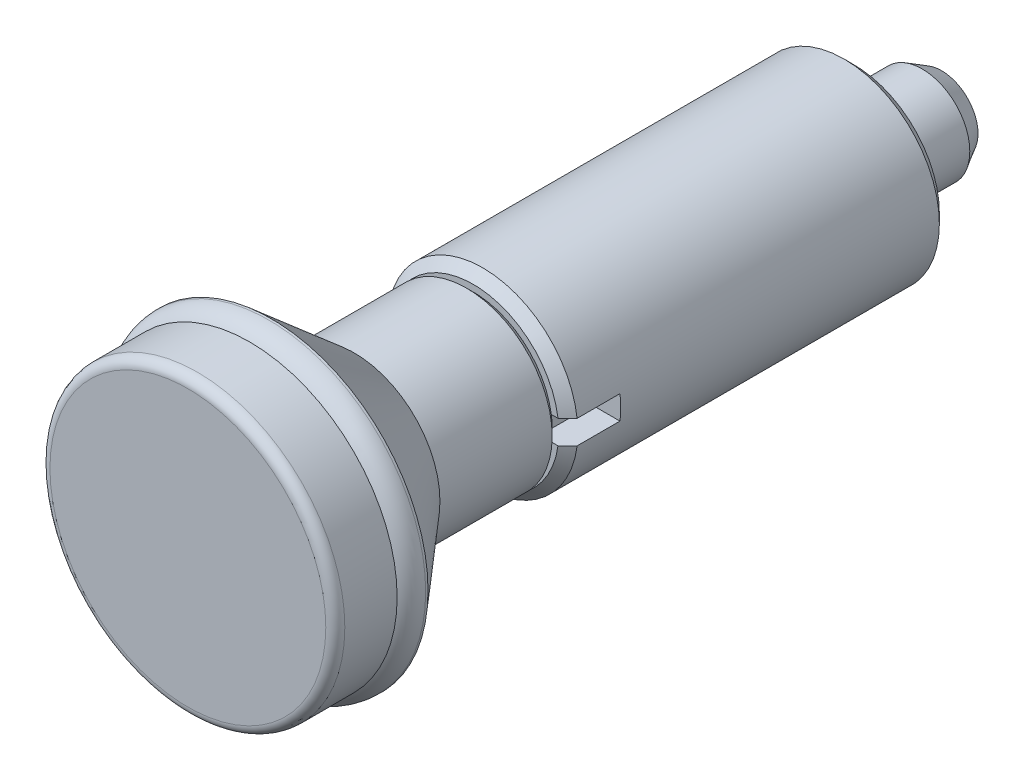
ISO-10303-21;
HEADER;
FILE_DESCRIPTION(('STEP AP214'),'2;1');
FILE_NAME('part.step','',(''),(''),'','','');
FILE_SCHEMA(('AUTOMOTIVE_DESIGN { 1 0 10303 214 1 1 1 1 }'));
ENDSEC;
DATA;
#1=APPLICATION_CONTEXT('core data for automotive mechanical design processes');
#2=APPLICATION_PROTOCOL_DEFINITION('international standard','automotive_design',2000,#1);
#3=PRODUCT_CONTEXT('',#1,'mechanical');
#4=PRODUCT('Part','Part','',(#3));
#5=PRODUCT_RELATED_PRODUCT_CATEGORY('part','',(#4));
#6=PRODUCT_DEFINITION_FORMATION('','',#4);
#7=PRODUCT_DEFINITION_CONTEXT('part definition',#1,'design');
#8=PRODUCT_DEFINITION('design','',#6,#7);
#9=PRODUCT_DEFINITION_SHAPE('','',#8);
#10=(LENGTH_UNIT() NAMED_UNIT(*) SI_UNIT(.MILLI.,.METRE.));
#11=(NAMED_UNIT(*) PLANE_ANGLE_UNIT() SI_UNIT($,.RADIAN.));
#12=(NAMED_UNIT(*) SI_UNIT($,.STERADIAN.) SOLID_ANGLE_UNIT());
#13=UNCERTAINTY_MEASURE_WITH_UNIT(LENGTH_MEASURE(1.E-05),#10,'distance_accuracy_value','');
#14=(GEOMETRIC_REPRESENTATION_CONTEXT(3) GLOBAL_UNCERTAINTY_ASSIGNED_CONTEXT((#13)) GLOBAL_UNIT_ASSIGNED_CONTEXT((#10,
#11,#12)) REPRESENTATION_CONTEXT('',''));
#15=CARTESIAN_POINT('',(0.,0.,0.));
#16=DIRECTION('',(0.,0.,1.));
#17=DIRECTION('',(1.,0.,0.));
#18=AXIS2_PLACEMENT_3D('',#15,#16,#17);
#19=CARTESIAN_POINT('',(0.,8.99999999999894,40.));
#20=DIRECTION('',(0.,0.,1.));
#21=DIRECTION('',(1.,0.,0.));
#22=AXIS2_PLACEMENT_3D('',#19,#20,#21);
#23=PLANE('',#22);
#24=DIRECTION('',(-1.,0.,0.));
#25=VECTOR('',#24,1.);
#26=CARTESIAN_POINT('',(-7.,1.25,40.));
#27=LINE('',#26,#25);
#28=CARTESIAN_POINT('',(-8.20533363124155,1.25,40.));
#29=VERTEX_POINT('',#28);
#30=CARTESIAN_POINT('',(-8.91277173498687,1.25,40.));
#31=VERTEX_POINT('',#30);
#32=EDGE_CURVE('E330',#29,#31,#27,.T.);
#33=ORIENTED_EDGE('',*,*,#32,.F.);
#34=CARTESIAN_POINT('',(0.,0.,40.));
#35=DIRECTION('',(0.,0.,1.));
#36=DIRECTION('',(1.,0.,0.));
#37=AXIS2_PLACEMENT_3D('',#34,#35,#36);
#38=CIRCLE('',#37,8.29999999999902);
#39=CARTESIAN_POINT('',(8.20533363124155,1.25,40.));
#40=VERTEX_POINT('',#39);
#41=EDGE_CURVE('E180',#40,#29,#38,.T.);
#42=ORIENTED_EDGE('',*,*,#41,.F.);
#43=DIRECTION('',(-1.,0.,0.));
#44=VECTOR('',#43,1.);
#45=CARTESIAN_POINT('',(7.,1.25,40.));
#46=LINE('',#45,#44);
#47=CARTESIAN_POINT('',(8.91277173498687,1.25,40.));
#48=VERTEX_POINT('',#47);
#49=EDGE_CURVE('E151',#48,#40,#46,.T.);
#50=ORIENTED_EDGE('',*,*,#49,.F.);
#51=CARTESIAN_POINT('',(0.,0.,40.));
#52=DIRECTION('',(0.,0.,1.));
#53=DIRECTION('',(1.,0.,0.));
#54=AXIS2_PLACEMENT_3D('',#51,#52,#53);
#55=CIRCLE('',#54,8.99999999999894);
#56=EDGE_CURVE('E176',#48,#31,#55,.T.);
#57=ORIENTED_EDGE('',*,*,#56,.T.);
#58=EDGE_LOOP('',(#33,#42,#50,#57));
#59=FACE_BOUND('',#58,.T.);
#60=ADVANCED_FACE('F14',(#59),#23,.T.);
#61=CARTESIAN_POINT('',(0.,0.,40.));
#62=DIRECTION('',(0.,0.,-1.));
#63=DIRECTION('',(-1.,0.,0.));
#64=AXIS2_PLACEMENT_3D('',#61,#62,#63);
#65=CONICAL_SURFACE('',#64,8.99999999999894,0.785398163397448);
#66=CARTESIAN_POINT('',(-4.73715555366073,1.25,44.1006997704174));
#67=CARTESIAN_POINT('',(-4.92218891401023,1.25,43.9217675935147));
#68=CARTESIAN_POINT('',(-5.10690410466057,1.25,43.742507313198));
#69=CARTESIAN_POINT('',(-5.47583283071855,1.25,43.3834722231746));
#70=CARTESIAN_POINT('',(-5.66004636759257,1.25,43.2036974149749));
#71=CARTESIAN_POINT('',(-6.02810627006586,1.25,42.8437751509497));
#72=CARTESIAN_POINT('',(-6.21195263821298,1.25,42.6636276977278));
#73=CARTESIAN_POINT('',(-6.57936050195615,1.25,42.303042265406));
#74=CARTESIAN_POINT('',(-6.76292199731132,1.25,42.1226042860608));
#75=CARTESIAN_POINT('',(-7.31327151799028,1.25,41.5809576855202));
#76=CARTESIAN_POINT('',(-7.67972840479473,1.25,41.219412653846));
#77=CARTESIAN_POINT('',(-8.4120730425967,1.25,40.4957455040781));
#78=CARTESIAN_POINT('',(-8.77796079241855,1.25,40.1336233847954));
#79=CARTESIAN_POINT('',(-9.50933794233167,1.25,39.4089852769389));
#80=CARTESIAN_POINT('',(-9.87482734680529,1.25,39.0464692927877));
#81=CARTESIAN_POINT('',(-10.6055262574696,1.25,38.3211560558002));
#82=CARTESIAN_POINT('',(-10.9707357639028,1.25,37.9583588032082));
#83=CARTESIAN_POINT('',(-12.0660458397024,1.25,36.8696339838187));
#84=CARTESIAN_POINT('',(-12.795821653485,1.25,36.1433796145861));
#85=CARTESIAN_POINT('',(-13.5254167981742,1.25,35.4169443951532));
#86=B_SPLINE_CURVE_WITH_KNOTS('',3,(#66,#67,#68,#69,#70,#71,#72,#73,#74,#75,#76,#77,#78,#79,#80,
#81,#82,#83,#84,#85),.UNSPECIFIED.,.F.,.F.,(4,2,2,2,2,2,2,2,2,4),(0.,0.772194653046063,
1.54438704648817,2.31657406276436,3.08876173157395,4.63312099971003,6.17748345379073,
7.72182874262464,9.26617269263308,12.3548872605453),.UNSPECIFIED.);
#87=CARTESIAN_POINT('',(-9.92156741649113,1.25,39.));
#88=VERTEX_POINT('',#87);
#89=EDGE_CURVE('E22',#31,#88,#86,.T.);
#90=ORIENTED_EDGE('',*,*,#89,.F.);
#91=ORIENTED_EDGE('',*,*,#56,.F.);
#92=CARTESIAN_POINT('',(13.9029555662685,1.25,35.0409644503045));
#93=CARTESIAN_POINT('',(13.1734482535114,1.25,35.7674860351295));
#94=CARTESIAN_POINT('',(12.4437703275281,1.25,36.4938368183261));
#95=CARTESIAN_POINT('',(11.3486675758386,1.25,37.5827689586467));
#96=CARTESIAN_POINT('',(10.9835368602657,1.25,37.9456461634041));
#97=CARTESIAN_POINT('',(10.2530237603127,1.25,38.6711476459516));
#98=CARTESIAN_POINT('',(9.88764137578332,1.25,39.0337719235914));
#99=CARTESIAN_POINT('',(9.15652427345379,1.25,39.7586710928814));
#100=CARTESIAN_POINT('',(8.79078955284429,1.25,40.1209459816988));
#101=CARTESIAN_POINT('',(8.05882030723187,1.25,40.8449895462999));
#102=CARTESIAN_POINT('',(7.69258578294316,1.25,41.2067582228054));
#103=CARTESIAN_POINT('',(6.95936504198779,1.25,41.9295389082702));
#104=CARTESIAN_POINT('',(6.59237882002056,1.25,42.2905509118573));
#105=CARTESIAN_POINT('',(6.04099141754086,1.25,42.8311448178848));
#106=CARTESIAN_POINT('',(5.85704383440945,1.25,43.0111891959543));
#107=CARTESIAN_POINT('',(5.48873931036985,1.25,43.3708593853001));
#108=CARTESIAN_POINT('',(5.30438236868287,1.25,43.5504851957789));
#109=CARTESIAN_POINT('',(5.11976761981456,1.25,43.7298462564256));
#110=B_SPLINE_CURVE_WITH_KNOTS('',3,(#92,#93,#94,#95,#96,#97,#98,#99,#100,#101,#102,#103,#104,
#105,#106,#107,#108,#109),.UNSPECIFIED.,.F.,.F.,(4,2,2,2,2,2,2,2,4),(0.,3.08871061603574,
4.63305596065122,6.17740222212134,7.72176090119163,9.26611737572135,10.8104847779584,
11.5826721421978,12.3548609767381),.UNSPECIFIED.);
#111=CARTESIAN_POINT('',(9.92156741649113,1.25,39.));
#112=VERTEX_POINT('',#111);
#113=EDGE_CURVE('E228',#112,#48,#110,.T.);
#114=ORIENTED_EDGE('',*,*,#113,.F.);
#115=CARTESIAN_POINT('',(0.,0.,39.));
#116=DIRECTION('',(0.,0.,1.));
#117=DIRECTION('',(1.,0.,0.));
#118=AXIS2_PLACEMENT_3D('',#115,#116,#117);
#119=CIRCLE('',#118,9.99999999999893);
#120=EDGE_CURVE('E173',#112,#88,#119,.T.);
#121=ORIENTED_EDGE('',*,*,#120,.T.);
#122=EDGE_LOOP('',(#90,#91,#114,#121));
#123=FACE_BOUND('',#122,.T.);
#124=ADVANCED_FACE('F259',(#123),#65,.T.);
#125=CARTESIAN_POINT('',(0.,0.,70.));
#126=DIRECTION('',(0.,0.,1.));
#127=DIRECTION('',(1.,0.,0.));
#128=AXIS2_PLACEMENT_3D('',#125,#126,#127);
#129=CYLINDRICAL_SURFACE('',#128,9.99999999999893);
#130=DIRECTION('',(0.,0.,1.));
#131=VECTOR('',#130,1.);
#132=CARTESIAN_POINT('',(-9.92156741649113,1.25,70.));
#133=LINE('',#132,#131);
#134=CARTESIAN_POINT('',(-9.92156741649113,1.25,34.5));
#135=VERTEX_POINT('',#134);
#136=EDGE_CURVE('E140',#88,#135,#133,.F.);
#137=ORIENTED_EDGE('',*,*,#136,.F.);
#138=ORIENTED_EDGE('',*,*,#120,.F.);
#139=DIRECTION('',(0.,0.,1.));
#140=VECTOR('',#139,1.);
#141=CARTESIAN_POINT('',(9.92156741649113,1.25,70.));
#142=LINE('',#141,#140);
#143=CARTESIAN_POINT('',(9.92156741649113,1.25,34.5));
#144=VERTEX_POINT('',#143);
#145=EDGE_CURVE('E170',#144,#112,#142,.T.);
#146=ORIENTED_EDGE('',*,*,#145,.F.);
#147=CARTESIAN_POINT('',(0.,0.,34.5));
#148=DIRECTION('',(0.,0.,1.));
#149=DIRECTION('',(1.,0.,0.));
#150=AXIS2_PLACEMENT_3D('',#147,#148,#149);
#151=CIRCLE('',#150,9.99999999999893);
#152=CARTESIAN_POINT('',(9.92156741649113,-1.25,34.5));
#153=VERTEX_POINT('',#152);
#154=EDGE_CURVE('E288',#144,#153,#151,.F.);
#155=ORIENTED_EDGE('',*,*,#154,.T.);
#156=DIRECTION('',(0.,0.,1.));
#157=VECTOR('',#156,1.);
#158=CARTESIAN_POINT('',(9.92156741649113,-1.25,70.));
#159=LINE('',#158,#157);
#160=CARTESIAN_POINT('',(9.92156741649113,-1.25,39.));
#161=VERTEX_POINT('',#160);
#162=EDGE_CURVE('E168',#161,#153,#159,.F.);
#163=ORIENTED_EDGE('',*,*,#162,.F.);
#164=CARTESIAN_POINT('',(-9.92156741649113,-1.25,39.));
#165=VERTEX_POINT('',#164);
#166=EDGE_CURVE('E172',#165,#161,#119,.T.);
#167=ORIENTED_EDGE('',*,*,#166,.F.);
#168=DIRECTION('',(0.,0.,1.));
#169=VECTOR('',#168,1.);
#170=CARTESIAN_POINT('',(-9.92156741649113,-1.25,70.));
#171=LINE('',#170,#169);
#172=CARTESIAN_POINT('',(-9.92156741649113,-1.25,34.5));
#173=VERTEX_POINT('',#172);
#174=EDGE_CURVE('E29',#173,#165,#171,.T.);
#175=ORIENTED_EDGE('',*,*,#174,.F.);
#176=CARTESIAN_POINT('',(0.,0.,34.5));
#177=DIRECTION('',(0.,0.,1.));
#178=DIRECTION('',(1.,0.,0.));
#179=AXIS2_PLACEMENT_3D('',#176,#177,#178);
#180=CIRCLE('',#179,9.99999999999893);
#181=EDGE_CURVE('E9',#173,#135,#180,.F.);
#182=ORIENTED_EDGE('',*,*,#181,.T.);
#183=EDGE_LOOP('',(#137,#138,#146,#155,#163,#167,#175,#182));
#184=FACE_BOUND('',#183,.T.);
#185=CARTESIAN_POINT('',(0.,0.,1.));
#186=DIRECTION('',(0.,0.,1.));
#187=DIRECTION('',(1.,0.,0.));
#188=AXIS2_PLACEMENT_3D('',#185,#186,#187);
#189=CIRCLE('',#188,9.99999999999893);
#190=CARTESIAN_POINT('',(9.99999999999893,0.,1.));
#191=VERTEX_POINT('',#190);
#192=EDGE_CURVE('E216',#191,#191,#189,.T.);
#193=ORIENTED_EDGE('',*,*,#192,.T.);
#194=EDGE_LOOP('',(#193));
#195=FACE_BOUND('',#194,.T.);
#196=ADVANCED_FACE('F16',(#184,#195),#129,.T.);
#197=CARTESIAN_POINT('',(0.,0.,1.));
#198=DIRECTION('',(0.,0.,1.));
#199=DIRECTION('',(1.,0.,0.));
#200=AXIS2_PLACEMENT_3D('',#197,#198,#199);
#201=CONICAL_SURFACE('',#200,9.99999999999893,0.785398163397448);
#202=CARTESIAN_POINT('',(0.,0.,0.));
#203=DIRECTION('',(0.,0.,1.));
#204=DIRECTION('',(1.,0.,0.));
#205=AXIS2_PLACEMENT_3D('',#202,#203,#204);
#206=CIRCLE('',#205,8.99999999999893);
#207=CARTESIAN_POINT('',(8.99999999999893,0.,0.));
#208=VERTEX_POINT('',#207);
#209=EDGE_CURVE('E213',#208,#208,#206,.T.);
#210=ORIENTED_EDGE('',*,*,#209,.T.);
#211=EDGE_LOOP('',(#210));
#212=FACE_BOUND('',#211,.T.);
#213=ORIENTED_EDGE('',*,*,#192,.F.);
#214=EDGE_LOOP('',(#213));
#215=FACE_BOUND('',#214,.T.);
#216=ADVANCED_FACE('F470',(#212,#215),#201,.T.);
#217=CARTESIAN_POINT('',(0.,4.99999999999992,0.));
#218=DIRECTION('',(0.,0.,-1.));
#219=DIRECTION('',(-1.,0.,0.));
#220=AXIS2_PLACEMENT_3D('',#217,#218,#219);
#221=PLANE('',#220);
#222=CARTESIAN_POINT('',(0.,0.,0.));
#223=DIRECTION('',(0.,0.,1.));
#224=DIRECTION('',(1.,0.,0.));
#225=AXIS2_PLACEMENT_3D('',#222,#223,#224);
#226=CIRCLE('',#225,4.99999999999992);
#227=CARTESIAN_POINT('',(4.99999999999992,0.,0.));
#228=VERTEX_POINT('',#227);
#229=EDGE_CURVE('E210',#228,#228,#226,.T.);
#230=ORIENTED_EDGE('',*,*,#229,.T.);
#231=EDGE_LOOP('',(#230));
#232=FACE_BOUND('',#231,.T.);
#233=ORIENTED_EDGE('',*,*,#209,.F.);
#234=EDGE_LOOP('',(#233));
#235=FACE_BOUND('',#234,.T.);
#236=ADVANCED_FACE('F460',(#232,#235),#221,.T.);
#237=CARTESIAN_POINT('',(0.,0.,70.));
#238=DIRECTION('',(0.,0.,1.));
#239=DIRECTION('',(1.,0.,0.));
#240=AXIS2_PLACEMENT_3D('',#237,#238,#239);
#241=CYLINDRICAL_SURFACE('',#240,4.99999999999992);
#242=CARTESIAN_POINT('',(0.,0.,-7.2));
#243=DIRECTION('',(0.,0.,1.));
#244=DIRECTION('',(1.,0.,0.));
#245=AXIS2_PLACEMENT_3D('',#242,#243,#244);
#246=CIRCLE('',#245,4.99999999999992);
#247=CARTESIAN_POINT('',(4.99999999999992,0.,-7.2));
#248=VERTEX_POINT('',#247);
#249=EDGE_CURVE('E207',#248,#248,#246,.T.);
#250=ORIENTED_EDGE('',*,*,#249,.T.);
#251=EDGE_LOOP('',(#250));
#252=FACE_BOUND('',#251,.T.);
#253=ORIENTED_EDGE('',*,*,#229,.F.);
#254=EDGE_LOOP('',(#253));
#255=FACE_BOUND('',#254,.T.);
#256=ADVANCED_FACE('F450',(#252,#255),#241,.T.);
#257=CARTESIAN_POINT('',(0.,0.,-7.2));
#258=DIRECTION('',(0.,0.,1.));
#259=DIRECTION('',(1.,0.,0.));
#260=AXIS2_PLACEMENT_3D('',#257,#258,#259);
#261=CONICAL_SURFACE('',#260,4.99999999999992,0.523598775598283);
#262=CARTESIAN_POINT('',(0.,0.,-9.2409344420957));
#263=DIRECTION('',(0.,0.,1.));
#264=DIRECTION('',(1.,0.,0.));
#265=AXIS2_PLACEMENT_3D('',#262,#263,#264);
#266=CIRCLE('',#265,3.82166595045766);
#267=CARTESIAN_POINT('',(3.82166595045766,0.,-9.2409344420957));
#268=VERTEX_POINT('',#267);
#269=EDGE_CURVE('E204',#268,#268,#266,.T.);
#270=ORIENTED_EDGE('',*,*,#269,.T.);
#271=EDGE_LOOP('',(#270));
#272=FACE_BOUND('',#271,.T.);
#273=ORIENTED_EDGE('',*,*,#249,.F.);
#274=EDGE_LOOP('',(#273));
#275=FACE_BOUND('',#274,.T.);
#276=ADVANCED_FACE('F440',(#272,#275),#261,.T.);
#277=CARTESIAN_POINT('',(0.,0.,0.));
#278=DIRECTION('',(0.,0.,1.));
#279=DIRECTION('',(0.,1.,0.));
#280=AXIS2_PLACEMENT_3D('',#277,#278,#279);
#281=SPHERICAL_SURFACE('',#280,10.);
#282=ORIENTED_EDGE('',*,*,#269,.F.);
#283=EDGE_LOOP('',(#282));
#284=FACE_BOUND('',#283,.T.);
#285=ADVANCED_FACE('F430',(#284),#281,.T.);
#286=CARTESIAN_POINT('',(0.,0.,70.));
#287=DIRECTION('',(0.,0.,1.));
#288=DIRECTION('',(1.,0.,0.));
#289=AXIS2_PLACEMENT_3D('',#286,#287,#288);
#290=PLANE('',#289);
#291=CARTESIAN_POINT('',(0.,0.,70.));
#292=DIRECTION('',(0.,0.,1.));
#293=DIRECTION('',(1.,0.,0.));
#294=AXIS2_PLACEMENT_3D('',#291,#292,#293);
#295=CIRCLE('',#294,14.5000000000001);
#296=CARTESIAN_POINT('',(14.5000000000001,0.,70.));
#297=VERTEX_POINT('',#296);
#298=EDGE_CURVE('E201',#297,#297,#295,.T.);
#299=ORIENTED_EDGE('',*,*,#298,.T.);
#300=EDGE_LOOP('',(#299));
#301=FACE_BOUND('',#300,.T.);
#302=ADVANCED_FACE('F420',(#301),#290,.T.);
#303=CARTESIAN_POINT('',(0.,0.,69.));
#304=DIRECTION('',(0.,0.,1.));
#305=DIRECTION('',(1.,0.,0.));
#306=AXIS2_PLACEMENT_3D('',#303,#304,#305);
#307=TOROIDAL_SURFACE('',#306,14.5000000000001,1.);
#308=CARTESIAN_POINT('',(0.,0.,69.));
#309=DIRECTION('',(0.,0.,1.));
#310=DIRECTION('',(1.,0.,0.));
#311=AXIS2_PLACEMENT_3D('',#308,#309,#310);
#312=CIRCLE('',#311,15.5);
#313=CARTESIAN_POINT('',(15.5,0.,69.));
#314=VERTEX_POINT('',#313);
#315=EDGE_CURVE('E198',#314,#314,#312,.T.);
#316=ORIENTED_EDGE('',*,*,#315,.T.);
#317=EDGE_LOOP('',(#316));
#318=FACE_BOUND('',#317,.T.);
#319=ORIENTED_EDGE('',*,*,#298,.F.);
#320=EDGE_LOOP('',(#319));
#321=FACE_BOUND('',#320,.T.);
#322=ADVANCED_FACE('F410',(#318,#321),#307,.T.);
#323=CARTESIAN_POINT('',(0.,0.,70.));
#324=DIRECTION('',(0.,0.,1.));
#325=DIRECTION('',(1.,0.,0.));
#326=AXIS2_PLACEMENT_3D('',#323,#324,#325);
#327=CYLINDRICAL_SURFACE('',#326,15.5);
#328=CARTESIAN_POINT('',(0.,0.,63.5));
#329=DIRECTION('',(0.,0.,1.));
#330=DIRECTION('',(1.,0.,0.));
#331=AXIS2_PLACEMENT_3D('',#328,#329,#330);
#332=CIRCLE('',#331,15.5);
#333=CARTESIAN_POINT('',(15.5,0.,63.5));
#334=VERTEX_POINT('',#333);
#335=EDGE_CURVE('E195',#334,#334,#332,.T.);
#336=ORIENTED_EDGE('',*,*,#335,.T.);
#337=EDGE_LOOP('',(#336));
#338=FACE_BOUND('',#337,.T.);
#339=ORIENTED_EDGE('',*,*,#315,.F.);
#340=EDGE_LOOP('',(#339));
#341=FACE_BOUND('',#340,.T.);
#342=ADVANCED_FACE('F400',(#338,#341),#327,.T.);
#343=CARTESIAN_POINT('',(0.,0.,61.5000000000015));
#344=DIRECTION('',(0.,0.,1.));
#345=DIRECTION('',(1.,0.,0.));
#346=AXIS2_PLACEMENT_3D('',#343,#344,#345);
#347=TOROIDAL_SURFACE('',#346,14.0000000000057,2.49999999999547);
#348=CARTESIAN_POINT('',(0.,0.,61.5000033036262));
#349=DIRECTION('',(0.,0.,1.));
#350=DIRECTION('',(1.,0.,0.));
#351=AXIS2_PLACEMENT_3D('',#348,#349,#350);
#352=CIRCLE('',#351,16.499999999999);
#353=CARTESIAN_POINT('',(16.499999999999,0.,61.5000033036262));
#354=VERTEX_POINT('',#353);
#355=EDGE_CURVE('E192',#354,#354,#352,.T.);
#356=ORIENTED_EDGE('',*,*,#355,.T.);
#357=EDGE_LOOP('',(#356));
#358=FACE_BOUND('',#357,.T.);
#359=ORIENTED_EDGE('',*,*,#335,.F.);
#360=EDGE_LOOP('',(#359));
#361=FACE_BOUND('',#360,.T.);
#362=ADVANCED_FACE('F390',(#358,#361),#347,.T.);
#363=CARTESIAN_POINT('',(0.,0.,70.));
#364=DIRECTION('',(0.,0.,1.));
#365=DIRECTION('',(1.,0.,0.));
#366=AXIS2_PLACEMENT_3D('',#363,#364,#365);
#367=CYLINDRICAL_SURFACE('',#366,16.499999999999);
#368=CARTESIAN_POINT('',(0.,0.,61.2528361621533));
#369=DIRECTION('',(0.,0.,1.));
#370=DIRECTION('',(1.,0.,0.));
#371=AXIS2_PLACEMENT_3D('',#368,#369,#370);
#372=CIRCLE('',#371,16.499999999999);
#373=CARTESIAN_POINT('',(16.499999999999,0.,61.2528361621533));
#374=VERTEX_POINT('',#373);
#375=EDGE_CURVE('E189',#374,#374,#372,.T.);
#376=ORIENTED_EDGE('',*,*,#375,.T.);
#377=EDGE_LOOP('',(#376));
#378=FACE_BOUND('',#377,.T.);
#379=ORIENTED_EDGE('',*,*,#355,.F.);
#380=EDGE_LOOP('',(#379));
#381=FACE_BOUND('',#380,.T.);
#382=ADVANCED_FACE('F380',(#378,#381),#367,.T.);
#383=CARTESIAN_POINT('',(0.,0.,61.2528361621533));
#384=DIRECTION('',(0.,0.,1.));
#385=DIRECTION('',(1.,0.,0.));
#386=AXIS2_PLACEMENT_3D('',#383,#384,#385);
#387=CONICAL_SURFACE('',#386,16.499999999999,0.708466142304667);
#388=CARTESIAN_POINT('',(0.,0.,52.5));
#389=DIRECTION('',(0.,0.,1.));
#390=DIRECTION('',(1.,0.,0.));
#391=AXIS2_PLACEMENT_3D('',#388,#389,#390);
#392=CIRCLE('',#391,8.99999999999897);
#393=CARTESIAN_POINT('',(8.99999999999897,0.,52.5));
#394=VERTEX_POINT('',#393);
#395=EDGE_CURVE('E186',#394,#394,#392,.T.);
#396=ORIENTED_EDGE('',*,*,#395,.T.);
#397=EDGE_LOOP('',(#396));
#398=FACE_BOUND('',#397,.T.);
#399=ORIENTED_EDGE('',*,*,#375,.F.);
#400=EDGE_LOOP('',(#399));
#401=FACE_BOUND('',#400,.T.);
#402=ADVANCED_FACE('F369',(#398,#401),#387,.T.);
#403=CARTESIAN_POINT('',(0.,0.,70.));
#404=DIRECTION('',(0.,0.,1.));
#405=DIRECTION('',(1.,0.,0.));
#406=AXIS2_PLACEMENT_3D('',#403,#404,#405);
#407=CYLINDRICAL_SURFACE('',#406,8.99999999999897);
#408=CARTESIAN_POINT('',(0.,0.,40.7));
#409=DIRECTION('',(0.,0.,1.));
#410=DIRECTION('',(1.,0.,0.));
#411=AXIS2_PLACEMENT_3D('',#408,#409,#410);
#412=CIRCLE('',#411,8.99999999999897);
#413=CARTESIAN_POINT('',(8.99999999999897,0.,40.7));
#414=VERTEX_POINT('',#413);
#415=EDGE_CURVE('E183',#414,#414,#412,.T.);
#416=ORIENTED_EDGE('',*,*,#415,.T.);
#417=EDGE_LOOP('',(#416));
#418=FACE_BOUND('',#417,.T.);
#419=ORIENTED_EDGE('',*,*,#395,.F.);
#420=EDGE_LOOP('',(#419));
#421=FACE_BOUND('',#420,.T.);
#422=ADVANCED_FACE('F275',(#418,#421),#407,.T.);
#423=CARTESIAN_POINT('',(0.,0.,40.7));
#424=DIRECTION('',(0.,0.,1.));
#425=DIRECTION('',(1.,0.,0.));
#426=AXIS2_PLACEMENT_3D('',#423,#424,#425);
#427=CONICAL_SURFACE('',#426,8.99999999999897,0.785398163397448);
#428=ORIENTED_EDGE('',*,*,#41,.T.);
#429=CARTESIAN_POINT('',(0.,0.,40.));
#430=DIRECTION('',(0.,0.,1.));
#431=DIRECTION('',(1.,0.,0.));
#432=AXIS2_PLACEMENT_3D('',#429,#430,#431);
#433=CIRCLE('',#432,8.29999999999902);
#434=CARTESIAN_POINT('',(-8.20533363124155,-1.25,40.));
#435=VERTEX_POINT('',#434);
#436=EDGE_CURVE('E136',#435,#29,#433,.F.);
#437=ORIENTED_EDGE('',*,*,#436,.F.);
#438=CARTESIAN_POINT('',(8.20533363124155,-1.25,40.));
#439=VERTEX_POINT('',#438);
#440=EDGE_CURVE('E179',#435,#439,#38,.T.);
#441=ORIENTED_EDGE('',*,*,#440,.T.);
#442=CARTESIAN_POINT('',(0.,0.,40.));
#443=DIRECTION('',(0.,0.,1.));
#444=DIRECTION('',(1.,0.,0.));
#445=AXIS2_PLACEMENT_3D('',#442,#443,#444);
#446=CIRCLE('',#445,8.29999999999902);
#447=EDGE_CURVE('E164',#40,#439,#446,.F.);
#448=ORIENTED_EDGE('',*,*,#447,.F.);
#449=EDGE_LOOP('',(#428,#437,#441,#448));
#450=FACE_BOUND('',#449,.T.);
#451=ORIENTED_EDGE('',*,*,#415,.F.);
#452=EDGE_LOOP('',(#451));
#453=FACE_BOUND('',#452,.T.);
#454=ADVANCED_FACE('F270',(#450,#453),#427,.T.);
#455=DIRECTION('',(1.,0.,0.));
#456=VECTOR('',#455,1.);
#457=CARTESIAN_POINT('',(-7.,-1.25,40.));
#458=LINE('',#457,#456);
#459=CARTESIAN_POINT('',(-8.91277173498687,-1.25,40.));
#460=VERTEX_POINT('',#459);
#461=EDGE_CURVE('E110',#460,#435,#458,.T.);
#462=ORIENTED_EDGE('',*,*,#461,.F.);
#463=CARTESIAN_POINT('',(8.91277173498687,-1.25,40.));
#464=VERTEX_POINT('',#463);
#465=EDGE_CURVE('E37',#460,#464,#55,.T.);
#466=ORIENTED_EDGE('',*,*,#465,.T.);
#467=DIRECTION('',(1.,0.,0.));
#468=VECTOR('',#467,1.);
#469=CARTESIAN_POINT('',(7.,-1.25,40.));
#470=LINE('',#469,#468);
#471=EDGE_CURVE('E145',#439,#464,#470,.T.);
#472=ORIENTED_EDGE('',*,*,#471,.F.);
#473=ORIENTED_EDGE('',*,*,#440,.F.);
#474=EDGE_LOOP('',(#462,#466,#472,#473));
#475=FACE_BOUND('',#474,.T.);
#476=ADVANCED_FACE('F257',(#475),#23,.T.);
#477=CARTESIAN_POINT('',(-13.5254167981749,-1.25,35.4169443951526));
#478=CARTESIAN_POINT('',(-12.7958216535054,-1.25,36.1433796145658));
#479=CARTESIAN_POINT('',(-12.0660458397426,-1.25,36.8696339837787));
#480=CARTESIAN_POINT('',(-10.9707357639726,-1.25,37.9583588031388));
#481=CARTESIAN_POINT('',(-10.6055262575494,-1.25,38.321156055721));
#482=CARTESIAN_POINT('',(-9.87482734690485,-1.25,39.0464692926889));
#483=CARTESIAN_POINT('',(-9.50933794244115,-1.25,39.4089852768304));
#484=CARTESIAN_POINT('',(-8.77796079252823,-1.25,40.1336233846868));
#485=CARTESIAN_POINT('',(-8.41207304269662,-1.25,40.4957455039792));
#486=CARTESIAN_POINT('',(-7.67972840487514,-1.25,41.2194126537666));
#487=CARTESIAN_POINT('',(-7.31327151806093,-1.25,41.5809576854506));
#488=CARTESIAN_POINT('',(-6.7629219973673,-1.25,42.1226042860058));
#489=CARTESIAN_POINT('',(-6.57936050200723,-1.25,42.3030422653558));
#490=CARTESIAN_POINT('',(-6.21195263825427,-1.25,42.6636276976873));
#491=CARTESIAN_POINT('',(-6.02810627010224,-1.25,42.8437751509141));
#492=CARTESIAN_POINT('',(-5.66004636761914,-1.25,43.203697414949));
#493=CARTESIAN_POINT('',(-5.47583283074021,-1.25,43.3834722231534));
#494=CARTESIAN_POINT('',(-5.10690410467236,-1.25,43.7425073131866));
#495=CARTESIAN_POINT('',(-4.92218891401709,-1.25,43.9217675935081));
#496=CARTESIAN_POINT('',(-4.73715555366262,-1.25,44.1006997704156));
#497=B_SPLINE_CURVE_WITH_KNOTS('',3,(#477,#478,#479,#480,#481,#482,#483,#484,#485,#486,#487,
#488,#489,#490,#491,#492,#493,#494,#495,#496),.UNSPECIFIED.,.F.,.F.,(4,2,2,2,2,2,2,2,2,4),(0.,
3.08871456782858,4.63305851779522,6.17740380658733,7.7217662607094,9.26612552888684,
10.0383131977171,10.810500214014,11.5826926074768,12.3548872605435),.UNSPECIFIED.);
#498=EDGE_CURVE('E279',#165,#460,#497,.T.);
#499=ORIENTED_EDGE('',*,*,#498,.F.);
#500=ORIENTED_EDGE('',*,*,#166,.T.);
#501=CARTESIAN_POINT('',(5.11976761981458,-1.25,43.7298462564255));
#502=CARTESIAN_POINT('',(5.30438236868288,-1.25,43.5504851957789));
#503=CARTESIAN_POINT('',(5.48873931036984,-1.25,43.3708593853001));
#504=CARTESIAN_POINT('',(5.85704383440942,-1.25,43.0111891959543));
#505=CARTESIAN_POINT('',(6.04099141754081,-1.25,42.8311448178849));
#506=CARTESIAN_POINT('',(6.59237882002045,-1.25,42.2905509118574));
#507=CARTESIAN_POINT('',(6.95936504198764,-1.25,41.9295389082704));
#508=CARTESIAN_POINT('',(7.69258578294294,-1.25,41.2067582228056));
#509=CARTESIAN_POINT('',(8.05882030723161,-1.25,40.8449895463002));
#510=CARTESIAN_POINT('',(8.79078955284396,-1.25,40.1209459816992));
#511=CARTESIAN_POINT('',(9.15652427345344,-1.25,39.7586710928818));
#512=CARTESIAN_POINT('',(9.88764137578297,-1.25,39.0337719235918));
#513=CARTESIAN_POINT('',(10.2530237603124,-1.25,38.671147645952));
#514=CARTESIAN_POINT('',(10.9835368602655,-1.25,37.9456461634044));
#515=CARTESIAN_POINT('',(11.3486675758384,-1.25,37.5827689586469));
#516=CARTESIAN_POINT('',(12.443770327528,-1.25,36.4938368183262));
#517=CARTESIAN_POINT('',(13.1734482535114,-1.25,35.7674860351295));
#518=CARTESIAN_POINT('',(13.9029555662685,-1.25,35.0409644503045));
#519=B_SPLINE_CURVE_WITH_KNOTS('',3,(#501,#502,#503,#504,#505,#506,#507,#508,#509,#510,#511,
#512,#513,#514,#515,#516,#517,#518),.UNSPECIFIED.,.F.,.F.,(4,2,2,2,2,2,2,2,4),(0.,
0.772188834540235,1.54437619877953,3.08874360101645,4.63310007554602,6.17745875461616,
7.72180501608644,9.26615036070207,12.3548609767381),.UNSPECIFIED.);
#520=EDGE_CURVE('E219',#464,#161,#519,.T.);
#521=ORIENTED_EDGE('',*,*,#520,.F.);
#522=ORIENTED_EDGE('',*,*,#465,.F.);
#523=EDGE_LOOP('',(#499,#500,#521,#522));
#524=FACE_BOUND('',#523,.T.);
#525=ADVANCED_FACE('F235',(#524),#65,.T.);
#526=CARTESIAN_POINT('',(7.,1.25,34.5));
#527=DIRECTION('',(-1.,0.,0.));
#528=DIRECTION('',(0.,0.,1.));
#529=AXIS2_PLACEMENT_3D('',#526,#527,#528);
#530=PLANE('',#529);
#531=DIRECTION('',(0.,-1.,0.));
#532=VECTOR('',#531,1.);
#533=CARTESIAN_POINT('',(7.,1.25,40.));
#534=LINE('',#533,#532);
#535=CARTESIAN_POINT('',(7.,1.25,40.));
#536=VERTEX_POINT('',#535);
#537=CARTESIAN_POINT('',(7.,-1.25,40.));
#538=VERTEX_POINT('',#537);
#539=EDGE_CURVE('E142',#536,#538,#534,.T.);
#540=ORIENTED_EDGE('',*,*,#539,.T.);
#541=DIRECTION('',(0.,0.,1.));
#542=VECTOR('',#541,1.);
#543=CARTESIAN_POINT('',(7.,-1.25,34.5));
#544=LINE('',#543,#542);
#545=CARTESIAN_POINT('',(7.,-1.25,34.5));
#546=VERTEX_POINT('',#545);
#547=EDGE_CURVE('E160',#546,#538,#544,.T.);
#548=ORIENTED_EDGE('',*,*,#547,.F.);
#549=DIRECTION('',(0.,-1.,0.));
#550=VECTOR('',#549,1.);
#551=CARTESIAN_POINT('',(7.,1.25,34.5));
#552=LINE('',#551,#550);
#553=CARTESIAN_POINT('',(7.,1.25,34.5));
#554=VERTEX_POINT('',#553);
#555=EDGE_CURVE('E152',#554,#546,#552,.T.);
#556=ORIENTED_EDGE('',*,*,#555,.F.);
#557=DIRECTION('',(0.,0.,1.));
#558=VECTOR('',#557,1.);
#559=CARTESIAN_POINT('',(7.,1.25,34.5));
#560=LINE('',#559,#558);
#561=EDGE_CURVE('E161',#554,#536,#560,.T.);
#562=ORIENTED_EDGE('',*,*,#561,.T.);
#563=EDGE_LOOP('',(#540,#548,#556,#562));
#564=FACE_BOUND('',#563,.T.);
#565=ADVANCED_FACE('F247',(#564),#530,.F.);
#566=CARTESIAN_POINT('',(7.,1.25,34.5));
#567=DIRECTION('',(0.,1.,0.));
#568=DIRECTION('',(-1.,0.,0.));
#569=AXIS2_PLACEMENT_3D('',#566,#567,#568);
#570=PLANE('',#569);
#571=ORIENTED_EDGE('',*,*,#145,.T.);
#572=ORIENTED_EDGE('',*,*,#113,.T.);
#573=ORIENTED_EDGE('',*,*,#49,.T.);
#574=EDGE_CURVE('E149',#40,#536,#46,.T.);
#575=ORIENTED_EDGE('',*,*,#574,.T.);
#576=ORIENTED_EDGE('',*,*,#561,.F.);
#577=DIRECTION('',(-1.,0.,0.));
#578=VECTOR('',#577,1.);
#579=CARTESIAN_POINT('',(7.,1.25,34.5));
#580=LINE('',#579,#578);
#581=EDGE_CURVE('E158',#144,#554,#580,.T.);
#582=ORIENTED_EDGE('',*,*,#581,.F.);
#583=EDGE_LOOP('',(#571,#572,#573,#575,#576,#582));
#584=FACE_BOUND('',#583,.T.);
#585=ADVANCED_FACE('F243',(#584),#570,.F.);
#586=CARTESIAN_POINT('',(7.,-1.25,34.5));
#587=DIRECTION('',(0.,-1.,0.));
#588=DIRECTION('',(1.,0.,0.));
#589=AXIS2_PLACEMENT_3D('',#586,#587,#588);
#590=PLANE('',#589);
#591=ORIENTED_EDGE('',*,*,#162,.T.);
#592=DIRECTION('',(1.,0.,0.));
#593=VECTOR('',#592,1.);
#594=CARTESIAN_POINT('',(7.,-1.25,34.5));
#595=LINE('',#594,#593);
#596=EDGE_CURVE('E155',#546,#153,#595,.T.);
#597=ORIENTED_EDGE('',*,*,#596,.F.);
#598=ORIENTED_EDGE('',*,*,#547,.T.);
#599=EDGE_CURVE('E146',#538,#439,#470,.T.);
#600=ORIENTED_EDGE('',*,*,#599,.T.);
#601=ORIENTED_EDGE('',*,*,#471,.T.);
#602=ORIENTED_EDGE('',*,*,#520,.T.);
#603=EDGE_LOOP('',(#591,#597,#598,#600,#601,#602));
#604=FACE_BOUND('',#603,.T.);
#605=ADVANCED_FACE('F239',(#604),#590,.F.);
#606=CARTESIAN_POINT('',(7.,-1.25,34.5));
#607=DIRECTION('',(0.,0.,1.));
#608=DIRECTION('',(1.,0.,0.));
#609=AXIS2_PLACEMENT_3D('',#606,#607,#608);
#610=PLANE('',#609);
#611=ORIENTED_EDGE('',*,*,#581,.T.);
#612=ORIENTED_EDGE('',*,*,#555,.T.);
#613=ORIENTED_EDGE('',*,*,#596,.T.);
#614=ORIENTED_EDGE('',*,*,#154,.F.);
#615=EDGE_LOOP('',(#611,#612,#613,#614));
#616=FACE_BOUND('',#615,.T.);
#617=ADVANCED_FACE('F242',(#616),#610,.T.);
#618=CARTESIAN_POINT('',(7.,-1.25,40.));
#619=DIRECTION('',(0.,0.,1.));
#620=DIRECTION('',(1.,0.,0.));
#621=AXIS2_PLACEMENT_3D('',#618,#619,#620);
#622=PLANE('',#621);
#623=ORIENTED_EDGE('',*,*,#447,.T.);
#624=ORIENTED_EDGE('',*,*,#599,.F.);
#625=ORIENTED_EDGE('',*,*,#539,.F.);
#626=ORIENTED_EDGE('',*,*,#574,.F.);
#627=EDGE_LOOP('',(#623,#624,#625,#626));
#628=FACE_BOUND('',#627,.T.);
#629=ADVANCED_FACE('F312',(#628),#622,.F.);
#630=CARTESIAN_POINT('',(-7.,1.25,34.5));
#631=DIRECTION('',(0.,1.,0.));
#632=DIRECTION('',(-1.,0.,0.));
#633=AXIS2_PLACEMENT_3D('',#630,#631,#632);
#634=PLANE('',#633);
#635=ORIENTED_EDGE('',*,*,#136,.T.);
#636=DIRECTION('',(-1.,0.,0.));
#637=VECTOR('',#636,1.);
#638=CARTESIAN_POINT('',(-7.,1.25,34.5));
#639=LINE('',#638,#637);
#640=CARTESIAN_POINT('',(-7.,1.25,34.5));
#641=VERTEX_POINT('',#640);
#642=EDGE_CURVE('E127',#641,#135,#639,.T.);
#643=ORIENTED_EDGE('',*,*,#642,.F.);
#644=DIRECTION('',(0.,0.,1.));
#645=VECTOR('',#644,1.);
#646=CARTESIAN_POINT('',(-7.,1.25,34.5));
#647=LINE('',#646,#645);
#648=CARTESIAN_POINT('',(-7.,1.25,40.));
#649=VERTEX_POINT('',#648);
#650=EDGE_CURVE('E122',#641,#649,#647,.T.);
#651=ORIENTED_EDGE('',*,*,#650,.T.);
#652=EDGE_CURVE('E114',#649,#29,#27,.T.);
#653=ORIENTED_EDGE('',*,*,#652,.T.);
#654=ORIENTED_EDGE('',*,*,#32,.T.);
#655=ORIENTED_EDGE('',*,*,#89,.T.);
#656=EDGE_LOOP('',(#635,#643,#651,#653,#654,#655));
#657=FACE_BOUND('',#656,.T.);
#658=ADVANCED_FACE('F308',(#657),#634,.F.);
#659=CARTESIAN_POINT('',(-7.,1.25,34.5));
#660=DIRECTION('',(1.,0.,0.));
#661=DIRECTION('',(0.,0.,-1.));
#662=AXIS2_PLACEMENT_3D('',#659,#660,#661);
#663=PLANE('',#662);
#664=DIRECTION('',(0.,1.,0.));
#665=VECTOR('',#664,1.);
#666=CARTESIAN_POINT('',(-7.,1.25,40.));
#667=LINE('',#666,#665);
#668=CARTESIAN_POINT('',(-7.,-1.25,40.));
#669=VERTEX_POINT('',#668);
#670=EDGE_CURVE('E119',#669,#649,#667,.T.);
#671=ORIENTED_EDGE('',*,*,#670,.T.);
#672=ORIENTED_EDGE('',*,*,#650,.F.);
#673=DIRECTION('',(0.,1.,0.));
#674=VECTOR('',#673,1.);
#675=CARTESIAN_POINT('',(-7.,1.25,34.5));
#676=LINE('',#675,#674);
#677=CARTESIAN_POINT('',(-7.,-1.25,34.5));
#678=VERTEX_POINT('',#677);
#679=EDGE_CURVE('E121',#678,#641,#676,.T.);
#680=ORIENTED_EDGE('',*,*,#679,.F.);
#681=DIRECTION('',(0.,0.,1.));
#682=VECTOR('',#681,1.);
#683=CARTESIAN_POINT('',(-7.,-1.25,34.5));
#684=LINE('',#683,#682);
#685=EDGE_CURVE('E108',#678,#669,#684,.T.);
#686=ORIENTED_EDGE('',*,*,#685,.T.);
#687=EDGE_LOOP('',(#671,#672,#680,#686));
#688=FACE_BOUND('',#687,.T.);
#689=ADVANCED_FACE('F118',(#688),#663,.F.);
#690=CARTESIAN_POINT('',(-7.,-1.25,34.5));
#691=DIRECTION('',(0.,-1.,0.));
#692=DIRECTION('',(1.,0.,0.));
#693=AXIS2_PLACEMENT_3D('',#690,#691,#692);
#694=PLANE('',#693);
#695=ORIENTED_EDGE('',*,*,#174,.T.);
#696=ORIENTED_EDGE('',*,*,#498,.T.);
#697=ORIENTED_EDGE('',*,*,#461,.T.);
#698=EDGE_CURVE('E105',#435,#669,#458,.T.);
#699=ORIENTED_EDGE('',*,*,#698,.T.);
#700=ORIENTED_EDGE('',*,*,#685,.F.);
#701=DIRECTION('',(1.,0.,0.));
#702=VECTOR('',#701,1.);
#703=CARTESIAN_POINT('',(-7.,-1.25,34.5));
#704=LINE('',#703,#702);
#705=EDGE_CURVE('E130',#173,#678,#704,.T.);
#706=ORIENTED_EDGE('',*,*,#705,.F.);
#707=EDGE_LOOP('',(#695,#696,#697,#699,#700,#706));
#708=FACE_BOUND('',#707,.T.);
#709=ADVANCED_FACE('F107',(#708),#694,.F.);
#710=CARTESIAN_POINT('',(-20.1251381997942,1.25,34.5));
#711=DIRECTION('',(0.,0.,1.));
#712=DIRECTION('',(1.,0.,0.));
#713=AXIS2_PLACEMENT_3D('',#710,#711,#712);
#714=PLANE('',#713);
#715=ORIENTED_EDGE('',*,*,#705,.T.);
#716=ORIENTED_EDGE('',*,*,#679,.T.);
#717=ORIENTED_EDGE('',*,*,#642,.T.);
#718=ORIENTED_EDGE('',*,*,#181,.F.);
#719=EDGE_LOOP('',(#715,#716,#717,#718));
#720=FACE_BOUND('',#719,.T.);
#721=ADVANCED_FACE('F306',(#720),#714,.T.);
#722=CARTESIAN_POINT('',(-20.1251381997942,1.25,40.));
#723=DIRECTION('',(0.,0.,1.));
#724=DIRECTION('',(1.,0.,0.));
#725=AXIS2_PLACEMENT_3D('',#722,#723,#724);
#726=PLANE('',#725);
#727=ORIENTED_EDGE('',*,*,#436,.T.);
#728=ORIENTED_EDGE('',*,*,#652,.F.);
#729=ORIENTED_EDGE('',*,*,#670,.F.);
#730=ORIENTED_EDGE('',*,*,#698,.F.);
#731=EDGE_LOOP('',(#727,#728,#729,#730));
#732=FACE_BOUND('',#731,.T.);
#733=ADVANCED_FACE('F125',(#732),#726,.F.);
#734=CLOSED_SHELL('',(#60,#124,#196,#216,#236,#256,#276,#285,#302,#322,#342,#362,#382,#402,#422,
#454,#476,#525,#565,#585,#605,#617,#629,#658,#689,#709,#721,#733));
#735=MANIFOLD_SOLID_BREP('B1',#734);
#736=ADVANCED_BREP_SHAPE_REPRESENTATION('',(#18,#735),#14);
#737=SHAPE_DEFINITION_REPRESENTATION(#9,#736);
ENDSEC;
END-ISO-10303-21;
